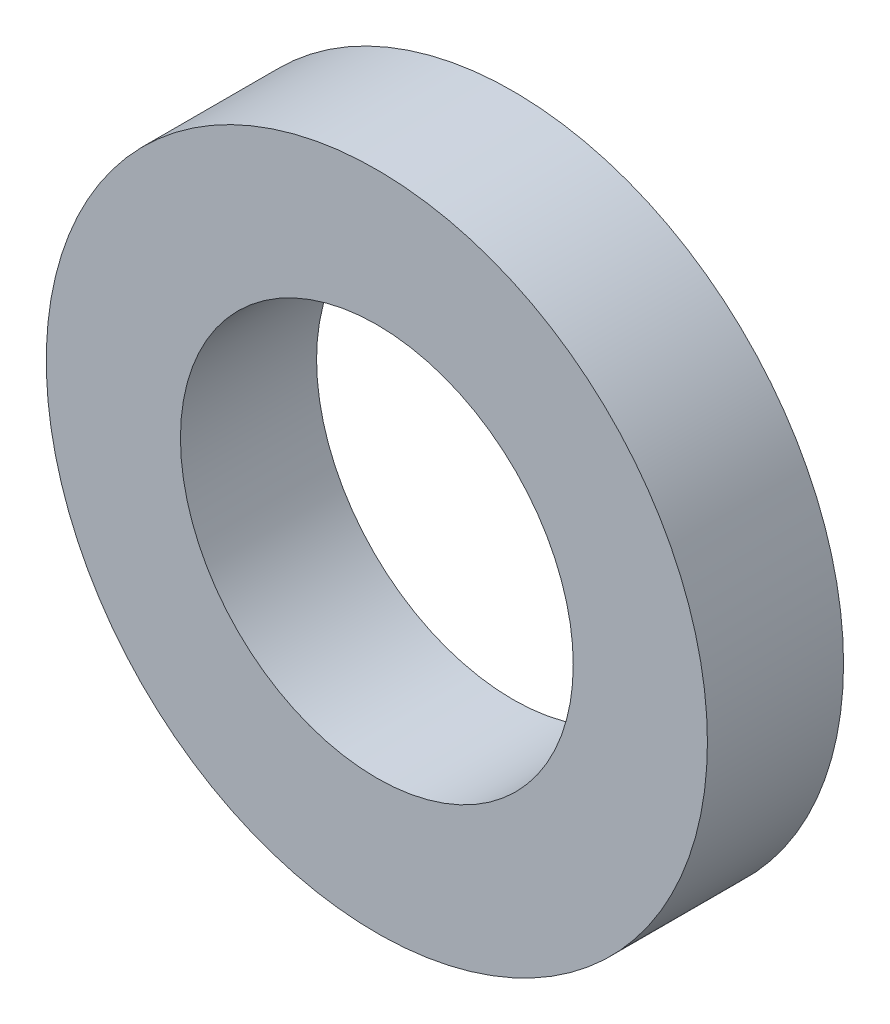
ISO-10303-21;
HEADER;
FILE_DESCRIPTION(('STEP AP214'),'2;1');
FILE_NAME('part.step','',(''),(''),'','','');
FILE_SCHEMA(('AUTOMOTIVE_DESIGN { 1 0 10303 214 1 1 1 1 }'));
ENDSEC;
DATA;
#1=APPLICATION_CONTEXT('core data for automotive mechanical design processes');
#2=APPLICATION_PROTOCOL_DEFINITION('international standard','automotive_design',2000,#1);
#3=PRODUCT_CONTEXT('',#1,'mechanical');
#4=PRODUCT('Part','Part','',(#3));
#5=PRODUCT_RELATED_PRODUCT_CATEGORY('part','',(#4));
#6=PRODUCT_DEFINITION_FORMATION('','',#4);
#7=PRODUCT_DEFINITION_CONTEXT('part definition',#1,'design');
#8=PRODUCT_DEFINITION('design','',#6,#7);
#9=PRODUCT_DEFINITION_SHAPE('','',#8);
#10=(LENGTH_UNIT() NAMED_UNIT(*) SI_UNIT(.MILLI.,.METRE.));
#11=(NAMED_UNIT(*) PLANE_ANGLE_UNIT() SI_UNIT($,.RADIAN.));
#12=(NAMED_UNIT(*) SI_UNIT($,.STERADIAN.) SOLID_ANGLE_UNIT());
#13=UNCERTAINTY_MEASURE_WITH_UNIT(LENGTH_MEASURE(1.E-05),#10,'distance_accuracy_value','');
#14=(GEOMETRIC_REPRESENTATION_CONTEXT(3) GLOBAL_UNCERTAINTY_ASSIGNED_CONTEXT((#13)) GLOBAL_UNIT_ASSIGNED_CONTEXT((#10,
#11,#12)) REPRESENTATION_CONTEXT('',''));
#15=CARTESIAN_POINT('',(0.,0.,0.));
#16=DIRECTION('',(0.,0.,1.));
#17=DIRECTION('',(1.,0.,0.));
#18=AXIS2_PLACEMENT_3D('',#15,#16,#17);
#19=CARTESIAN_POINT('',(0.,0.,-3.5));
#20=DIRECTION('',(0.,0.,1.));
#21=DIRECTION('',(1.,0.,0.));
#22=AXIS2_PLACEMENT_3D('',#19,#20,#21);
#23=CYLINDRICAL_SURFACE('',#22,17.);
#24=CARTESIAN_POINT('',(0.,0.,-3.5));
#25=DIRECTION('',(0.,0.,1.));
#26=DIRECTION('',(1.,0.,0.));
#27=AXIS2_PLACEMENT_3D('',#24,#25,#26);
#28=CIRCLE('',#27,17.);
#29=CARTESIAN_POINT('',(17.,0.,-3.5));
#30=VERTEX_POINT('',#29);
#31=EDGE_CURVE('E10',#30,#30,#28,.T.);
#32=ORIENTED_EDGE('',*,*,#31,.T.);
#33=EDGE_LOOP('',(#32));
#34=FACE_BOUND('',#33,.T.);
#35=CARTESIAN_POINT('',(0.,0.,3.5));
#36=DIRECTION('',(0.,0.,1.));
#37=DIRECTION('',(1.,0.,0.));
#38=AXIS2_PLACEMENT_3D('',#35,#36,#37);
#39=CIRCLE('',#38,17.);
#40=CARTESIAN_POINT('',(17.,0.,3.5));
#41=VERTEX_POINT('',#40);
#42=EDGE_CURVE('E42',#41,#41,#39,.T.);
#43=ORIENTED_EDGE('',*,*,#42,.F.);
#44=EDGE_LOOP('',(#43));
#45=FACE_BOUND('',#44,.T.);
#46=ADVANCED_FACE('F39',(#34,#45),#23,.T.);
#47=CARTESIAN_POINT('',(0.,0.,-3.5));
#48=DIRECTION('',(0.,0.,1.));
#49=DIRECTION('',(1.,0.,0.));
#50=AXIS2_PLACEMENT_3D('',#47,#48,#49);
#51=PLANE('',#50);
#52=CARTESIAN_POINT('',(0.,0.,-3.5));
#53=DIRECTION('',(0.,0.,1.));
#54=DIRECTION('',(1.,0.,0.));
#55=AXIS2_PLACEMENT_3D('',#52,#53,#54);
#56=CIRCLE('',#55,10.1);
#57=CARTESIAN_POINT('',(10.1,0.,-3.5));
#58=VERTEX_POINT('',#57);
#59=EDGE_CURVE('E49',#58,#58,#56,.T.);
#60=ORIENTED_EDGE('',*,*,#59,.T.);
#61=EDGE_LOOP('',(#60));
#62=FACE_BOUND('',#61,.T.);
#63=ORIENTED_EDGE('',*,*,#31,.F.);
#64=EDGE_LOOP('',(#63));
#65=FACE_BOUND('',#64,.T.);
#66=ADVANCED_FACE('F57',(#62,#65),#51,.F.);
#67=CARTESIAN_POINT('',(0.,0.,3.5));
#68=DIRECTION('',(0.,0.,1.));
#69=DIRECTION('',(1.,0.,0.));
#70=AXIS2_PLACEMENT_3D('',#67,#68,#69);
#71=PLANE('',#70);
#72=CARTESIAN_POINT('',(0.,0.,3.5));
#73=DIRECTION('',(0.,0.,1.));
#74=DIRECTION('',(1.,0.,0.));
#75=AXIS2_PLACEMENT_3D('',#72,#73,#74);
#76=CIRCLE('',#75,10.1);
#77=CARTESIAN_POINT('',(10.1,0.,3.5));
#78=VERTEX_POINT('',#77);
#79=EDGE_CURVE('E51',#78,#78,#76,.T.);
#80=ORIENTED_EDGE('',*,*,#79,.F.);
#81=EDGE_LOOP('',(#80));
#82=FACE_BOUND('',#81,.T.);
#83=ORIENTED_EDGE('',*,*,#42,.T.);
#84=EDGE_LOOP('',(#83));
#85=FACE_BOUND('',#84,.T.);
#86=ADVANCED_FACE('F63',(#82,#85),#71,.T.);
#87=CARTESIAN_POINT('',(0.,0.,-3.5));
#88=DIRECTION('',(0.,0.,1.));
#89=DIRECTION('',(1.,0.,0.));
#90=AXIS2_PLACEMENT_3D('',#87,#88,#89);
#91=CYLINDRICAL_SURFACE('',#90,10.1);
#92=ORIENTED_EDGE('',*,*,#59,.F.);
#93=EDGE_LOOP('',(#92));
#94=FACE_BOUND('',#93,.T.);
#95=ORIENTED_EDGE('',*,*,#79,.T.);
#96=EDGE_LOOP('',(#95));
#97=FACE_BOUND('',#96,.T.);
#98=ADVANCED_FACE('F60',(#94,#97),#91,.F.);
#99=CLOSED_SHELL('',(#46,#66,#86,#98));
#100=MANIFOLD_SOLID_BREP('B2',#99);
#101=ADVANCED_BREP_SHAPE_REPRESENTATION('',(#18,#100),#14);
#102=SHAPE_DEFINITION_REPRESENTATION(#9,#101);
ENDSEC;
END-ISO-10303-21;
